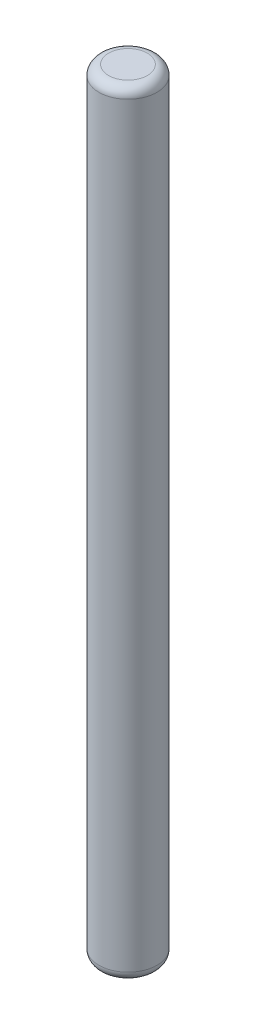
from build123d import *

# Parameters (mm, degrees)
SKETCH_1_R      = 0.75
EXTRUDE_1_DEPTH = 10
FILLET_1_R      = 0.25


with BuildPart() as part:
    # Sketch 1 → Extrude 1 (new, symmetric)
    with BuildSketch(Plane(origin=(0, 0, 0), x_dir=(1, 0, 0), z_dir=(0, 1, 0))):
        with Locations(Location((0, 0, 0), (0, 0, 270))):
            Circle(SKETCH_1_R)
    extrude(amount=EXTRUDE_1_DEPTH, both=True)

    # Fillet 1
    fillet_1_edges = [part.edges().sort_by_distance(p)[0] for p in [
        (0, -10, -0.75),
        (0, 10, -0.75),
    ]]
    fillet(fillet_1_edges, radius=FILLET_1_R)


solid = part.part
